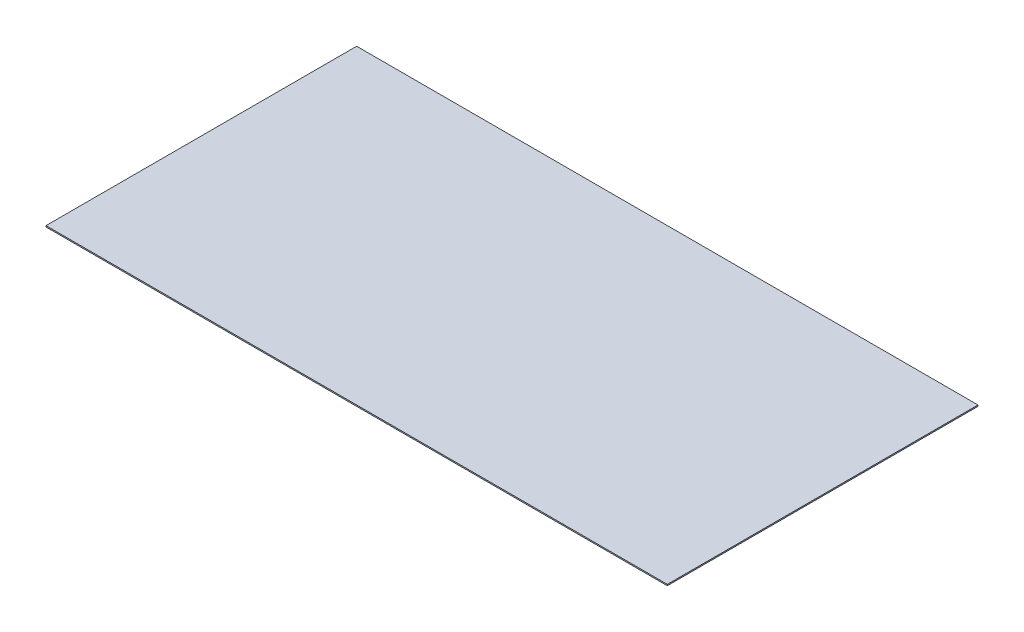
ISO-10303-21;
HEADER;
FILE_DESCRIPTION(('STEP AP214'),'2;1');
FILE_NAME('part.step','',(''),(''),'','','');
FILE_SCHEMA(('AUTOMOTIVE_DESIGN { 1 0 10303 214 1 1 1 1 }'));
ENDSEC;
DATA;
#1=APPLICATION_CONTEXT('core data for automotive mechanical design processes');
#2=APPLICATION_PROTOCOL_DEFINITION('international standard','automotive_design',2000,#1);
#3=PRODUCT_CONTEXT('',#1,'mechanical');
#4=PRODUCT('Part','Part','',(#3));
#5=PRODUCT_RELATED_PRODUCT_CATEGORY('part','',(#4));
#6=PRODUCT_DEFINITION_FORMATION('','',#4);
#7=PRODUCT_DEFINITION_CONTEXT('part definition',#1,'design');
#8=PRODUCT_DEFINITION('design','',#6,#7);
#9=PRODUCT_DEFINITION_SHAPE('','',#8);
#10=(LENGTH_UNIT() NAMED_UNIT(*) SI_UNIT(.MILLI.,.METRE.));
#11=(NAMED_UNIT(*) PLANE_ANGLE_UNIT() SI_UNIT($,.RADIAN.));
#12=(NAMED_UNIT(*) SI_UNIT($,.STERADIAN.) SOLID_ANGLE_UNIT());
#13=UNCERTAINTY_MEASURE_WITH_UNIT(LENGTH_MEASURE(1.E-05),#10,'distance_accuracy_value','');
#14=(GEOMETRIC_REPRESENTATION_CONTEXT(3) GLOBAL_UNCERTAINTY_ASSIGNED_CONTEXT((#13)) GLOBAL_UNIT_ASSIGNED_CONTEXT((#10,
#11,#12)) REPRESENTATION_CONTEXT('',''));
#15=CARTESIAN_POINT('',(0.,0.,0.));
#16=DIRECTION('',(0.,0.,1.));
#17=DIRECTION('',(1.,0.,0.));
#18=AXIS2_PLACEMENT_3D('',#15,#16,#17);
#19=CARTESIAN_POINT('',(100000.,0.,10000.));
#20=DIRECTION('',(0.,-1.,0.));
#21=DIRECTION('',(0.,0.,-1.));
#22=AXIS2_PLACEMENT_3D('',#19,#20,#21);
#23=PLANE('',#22);
#24=DIRECTION('',(0.,0.,-1.));
#25=VECTOR('',#24,1.);
#26=CARTESIAN_POINT('',(100000.,0.,10000.));
#27=LINE('',#26,#25);
#28=CARTESIAN_POINT('',(100000.,0.,10000.));
#29=VERTEX_POINT('',#28);
#30=CARTESIAN_POINT('',(100000.,0.,-40000.));
#31=VERTEX_POINT('',#30);
#32=EDGE_CURVE('E100',#29,#31,#27,.T.);
#33=ORIENTED_EDGE('',*,*,#32,.T.);
#34=DIRECTION('',(-1.,0.,0.));
#35=VECTOR('',#34,1.);
#36=CARTESIAN_POINT('',(100000.,0.,-40000.));
#37=LINE('',#36,#35);
#38=CARTESIAN_POINT('',(0.,0.,-40000.));
#39=VERTEX_POINT('',#38);
#40=EDGE_CURVE('E95',#31,#39,#37,.T.);
#41=ORIENTED_EDGE('',*,*,#40,.T.);
#42=DIRECTION('',(0.,0.,-1.));
#43=VECTOR('',#42,1.);
#44=CARTESIAN_POINT('',(0.,0.,10000.));
#45=LINE('',#44,#43);
#46=CARTESIAN_POINT('',(0.,0.,10000.));
#47=VERTEX_POINT('',#46);
#48=EDGE_CURVE('E11',#47,#39,#45,.T.);
#49=ORIENTED_EDGE('',*,*,#48,.F.);
#50=DIRECTION('',(-1.,0.,0.));
#51=VECTOR('',#50,1.);
#52=CARTESIAN_POINT('',(100000.,0.,10000.));
#53=LINE('',#52,#51);
#54=EDGE_CURVE('E106',#29,#47,#53,.T.);
#55=ORIENTED_EDGE('',*,*,#54,.F.);
#56=EDGE_LOOP('',(#33,#41,#49,#55));
#57=FACE_BOUND('',#56,.T.);
#58=ADVANCED_FACE('F42',(#57),#23,.F.);
#59=CARTESIAN_POINT('',(0.,0.,10000.));
#60=DIRECTION('',(1.,0.,0.));
#61=DIRECTION('',(0.,1.,0.));
#62=AXIS2_PLACEMENT_3D('',#59,#60,#61);
#63=PLANE('',#62);
#64=ORIENTED_EDGE('',*,*,#48,.T.);
#65=DIRECTION('',(0.,-1.,0.));
#66=VECTOR('',#65,1.);
#67=CARTESIAN_POINT('',(0.,0.,-40000.));
#68=LINE('',#67,#66);
#69=CARTESIAN_POINT('',(0.,-200.,-40000.));
#70=VERTEX_POINT('',#69);
#71=EDGE_CURVE('E85',#39,#70,#68,.T.);
#72=ORIENTED_EDGE('',*,*,#71,.T.);
#73=DIRECTION('',(0.,0.,-1.));
#74=VECTOR('',#73,1.);
#75=CARTESIAN_POINT('',(0.,-200.,10000.));
#76=LINE('',#75,#74);
#77=CARTESIAN_POINT('',(0.,-200.,10000.));
#78=VERTEX_POINT('',#77);
#79=EDGE_CURVE('E50',#78,#70,#76,.T.);
#80=ORIENTED_EDGE('',*,*,#79,.F.);
#81=DIRECTION('',(0.,-1.,0.));
#82=VECTOR('',#81,1.);
#83=CARTESIAN_POINT('',(0.,0.,10000.));
#84=LINE('',#83,#82);
#85=EDGE_CURVE('E86',#47,#78,#84,.T.);
#86=ORIENTED_EDGE('',*,*,#85,.F.);
#87=EDGE_LOOP('',(#64,#72,#80,#86));
#88=FACE_BOUND('',#87,.T.);
#89=ADVANCED_FACE('F83',(#88),#63,.F.);
#90=CARTESIAN_POINT('',(0.,-200.,10000.));
#91=DIRECTION('',(0.,1.,0.));
#92=DIRECTION('',(-1.,0.,0.));
#93=AXIS2_PLACEMENT_3D('',#90,#91,#92);
#94=PLANE('',#93);
#95=ORIENTED_EDGE('',*,*,#79,.T.);
#96=DIRECTION('',(1.,0.,0.));
#97=VECTOR('',#96,1.);
#98=CARTESIAN_POINT('',(0.,-200.,-40000.));
#99=LINE('',#98,#97);
#100=CARTESIAN_POINT('',(100000.,-200.,-40000.));
#101=VERTEX_POINT('',#100);
#102=EDGE_CURVE('E98',#70,#101,#99,.T.);
#103=ORIENTED_EDGE('',*,*,#102,.T.);
#104=DIRECTION('',(0.,0.,-1.));
#105=VECTOR('',#104,1.);
#106=CARTESIAN_POINT('',(100000.,-200.,10000.));
#107=LINE('',#106,#105);
#108=CARTESIAN_POINT('',(100000.,-200.,10000.));
#109=VERTEX_POINT('',#108);
#110=EDGE_CURVE('E112',#109,#101,#107,.T.);
#111=ORIENTED_EDGE('',*,*,#110,.F.);
#112=DIRECTION('',(1.,0.,0.));
#113=VECTOR('',#112,1.);
#114=CARTESIAN_POINT('',(0.,-200.,10000.));
#115=LINE('',#114,#113);
#116=EDGE_CURVE('E62',#78,#109,#115,.T.);
#117=ORIENTED_EDGE('',*,*,#116,.F.);
#118=EDGE_LOOP('',(#95,#103,#111,#117));
#119=FACE_BOUND('',#118,.T.);
#120=ADVANCED_FACE('F114',(#119),#94,.F.);
#121=CARTESIAN_POINT('',(100000.,0.,10000.));
#122=DIRECTION('',(-1.,0.,0.));
#123=DIRECTION('',(0.,0.,1.));
#124=AXIS2_PLACEMENT_3D('',#121,#122,#123);
#125=PLANE('',#124);
#126=ORIENTED_EDGE('',*,*,#110,.T.);
#127=DIRECTION('',(0.,1.,0.));
#128=VECTOR('',#127,1.);
#129=CARTESIAN_POINT('',(100000.,0.,-40000.));
#130=LINE('',#129,#128);
#131=EDGE_CURVE('E104',#101,#31,#130,.T.);
#132=ORIENTED_EDGE('',*,*,#131,.T.);
#133=ORIENTED_EDGE('',*,*,#32,.F.);
#134=DIRECTION('',(0.,1.,0.));
#135=VECTOR('',#134,1.);
#136=CARTESIAN_POINT('',(100000.,0.,10000.));
#137=LINE('',#136,#135);
#138=EDGE_CURVE('E57',#109,#29,#137,.T.);
#139=ORIENTED_EDGE('',*,*,#138,.F.);
#140=EDGE_LOOP('',(#126,#132,#133,#139));
#141=FACE_BOUND('',#140,.T.);
#142=ADVANCED_FACE('F116',(#141),#125,.F.);
#143=CARTESIAN_POINT('',(0.,0.,10000.));
#144=DIRECTION('',(0.,0.,1.));
#145=DIRECTION('',(1.,0.,0.));
#146=AXIS2_PLACEMENT_3D('',#143,#144,#145);
#147=PLANE('',#146);
#148=ORIENTED_EDGE('',*,*,#54,.T.);
#149=ORIENTED_EDGE('',*,*,#85,.T.);
#150=ORIENTED_EDGE('',*,*,#116,.T.);
#151=ORIENTED_EDGE('',*,*,#138,.T.);
#152=EDGE_LOOP('',(#148,#149,#150,#151));
#153=FACE_BOUND('',#152,.T.);
#154=ADVANCED_FACE('F117',(#153),#147,.T.);
#155=CARTESIAN_POINT('',(0.,0.,-40000.));
#156=DIRECTION('',(0.,0.,1.));
#157=DIRECTION('',(1.,0.,0.));
#158=AXIS2_PLACEMENT_3D('',#155,#156,#157);
#159=PLANE('',#158);
#160=ORIENTED_EDGE('',*,*,#40,.F.);
#161=ORIENTED_EDGE('',*,*,#131,.F.);
#162=ORIENTED_EDGE('',*,*,#102,.F.);
#163=ORIENTED_EDGE('',*,*,#71,.F.);
#164=EDGE_LOOP('',(#160,#161,#162,#163));
#165=FACE_BOUND('',#164,.T.);
#166=ADVANCED_FACE('F93',(#165),#159,.F.);
#167=CLOSED_SHELL('',(#58,#89,#120,#142,#154,#166));
#168=MANIFOLD_SOLID_BREP('B2',#167);
#169=ADVANCED_BREP_SHAPE_REPRESENTATION('',(#18,#168),#14);
#170=SHAPE_DEFINITION_REPRESENTATION(#9,#169);
ENDSEC;
END-ISO-10303-21;
